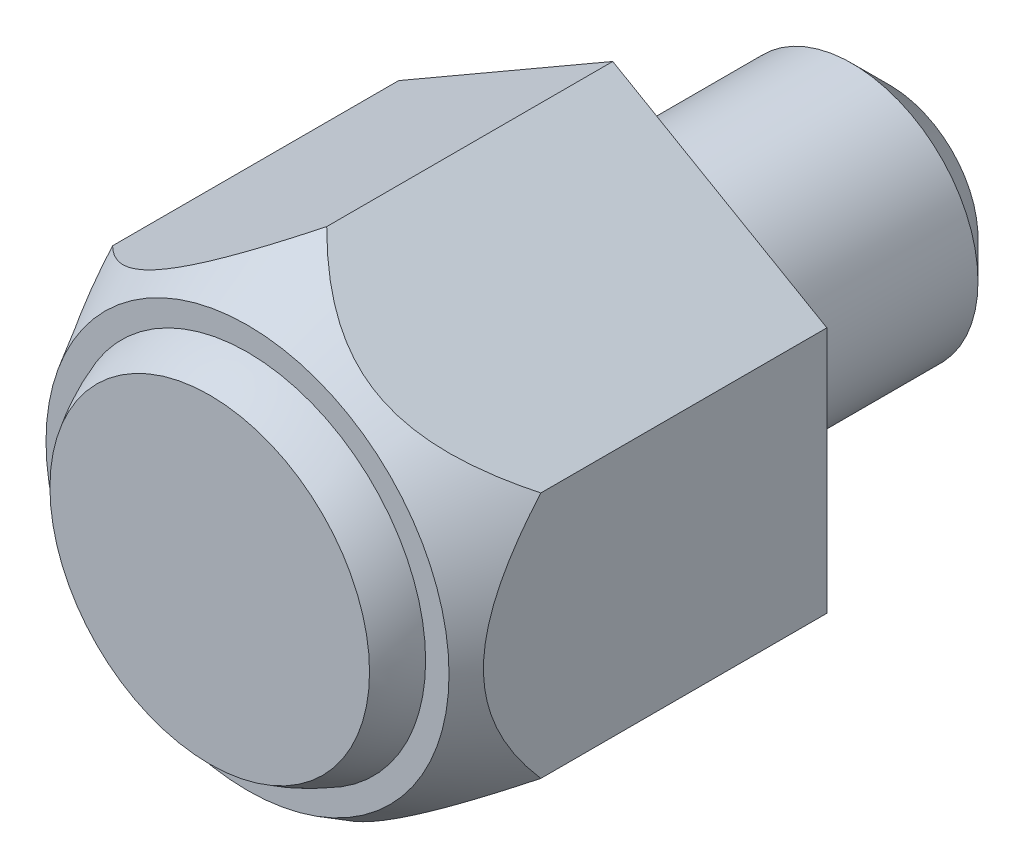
ISO-10303-21;
HEADER;
FILE_DESCRIPTION(('STEP AP214'),'2;1');
FILE_NAME('part.step','',(''),(''),'','','');
FILE_SCHEMA(('AUTOMOTIVE_DESIGN { 1 0 10303 214 1 1 1 1 }'));
ENDSEC;
DATA;
#1=APPLICATION_CONTEXT('core data for automotive mechanical design processes');
#2=APPLICATION_PROTOCOL_DEFINITION('international standard','automotive_design',2000,#1);
#3=PRODUCT_CONTEXT('',#1,'mechanical');
#4=PRODUCT('Part','Part','',(#3));
#5=PRODUCT_RELATED_PRODUCT_CATEGORY('part','',(#4));
#6=PRODUCT_DEFINITION_FORMATION('','',#4);
#7=PRODUCT_DEFINITION_CONTEXT('part definition',#1,'design');
#8=PRODUCT_DEFINITION('design','',#6,#7);
#9=PRODUCT_DEFINITION_SHAPE('','',#8);
#10=(LENGTH_UNIT() NAMED_UNIT(*) SI_UNIT(.MILLI.,.METRE.));
#11=(NAMED_UNIT(*) PLANE_ANGLE_UNIT() SI_UNIT($,.RADIAN.));
#12=(NAMED_UNIT(*) SI_UNIT($,.STERADIAN.) SOLID_ANGLE_UNIT());
#13=UNCERTAINTY_MEASURE_WITH_UNIT(LENGTH_MEASURE(1.E-05),#10,'distance_accuracy_value','');
#14=(GEOMETRIC_REPRESENTATION_CONTEXT(3) GLOBAL_UNCERTAINTY_ASSIGNED_CONTEXT((#13)) GLOBAL_UNIT_ASSIGNED_CONTEXT((#10,
#11,#12)) REPRESENTATION_CONTEXT('',''));
#15=CARTESIAN_POINT('',(0.,0.,0.));
#16=DIRECTION('',(0.,0.,1.));
#17=DIRECTION('',(1.,0.,0.));
#18=AXIS2_PLACEMENT_3D('',#15,#16,#17);
#19=CARTESIAN_POINT('',(0.,0.,16.));
#20=DIRECTION('',(0.,0.,1.));
#21=DIRECTION('',(1.,0.,0.));
#22=AXIS2_PLACEMENT_3D('',#19,#20,#21);
#23=PLANE('',#22);
#24=CARTESIAN_POINT('',(0.,0.,16.));
#25=DIRECTION('',(0.,0.,1.));
#26=DIRECTION('',(1.,0.,0.));
#27=AXIS2_PLACEMENT_3D('',#24,#25,#26);
#28=CIRCLE('',#27,6.34428877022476);
#29=CARTESIAN_POINT('',(6.34428877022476,0.,16.));
#30=VERTEX_POINT('',#29);
#31=EDGE_CURVE('E112',#30,#30,#28,.T.);
#32=ORIENTED_EDGE('',*,*,#31,.T.);
#33=EDGE_LOOP('',(#32));
#34=FACE_BOUND('',#33,.T.);
#35=ADVANCED_FACE('F14',(#34),#23,.T.);
#36=CARTESIAN_POINT('',(0.,0.,12.));
#37=DIRECTION('',(0.,0.,1.));
#38=DIRECTION('',(1.,0.,0.));
#39=AXIS2_PLACEMENT_3D('',#36,#37,#38);
#40=SPHERICAL_SURFACE('',#39,7.5);
#41=CARTESIAN_POINT('',(0.,0.,14.5));
#42=DIRECTION('',(0.,0.,1.));
#43=DIRECTION('',(1.,0.,0.));
#44=AXIS2_PLACEMENT_3D('',#41,#42,#43);
#45=CIRCLE('',#44,7.07106781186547);
#46=CARTESIAN_POINT('',(7.07106781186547,0.,14.5));
#47=VERTEX_POINT('',#46);
#48=EDGE_CURVE('E109',#47,#47,#45,.T.);
#49=CARTESIAN_POINT('',(7.07106781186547,0.,14.5));
#50=CARTESIAN_POINT('',(7.06526835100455,0.,14.5164033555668));
#51=CARTESIAN_POINT('',(7.05941180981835,0.,14.5327865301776));
#52=CARTESIAN_POINT('',(7.04758485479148,0.,14.5655117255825));
#53=CARTESIAN_POINT('',(7.04161444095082,0.,14.5818537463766));
#54=CARTESIAN_POINT('',(7.02956002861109,0.,14.6144958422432));
#55=CARTESIAN_POINT('',(7.02347603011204,0.,14.6307959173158));
#56=CARTESIAN_POINT('',(7.01119474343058,0.,14.6633533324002));
#57=CARTESIAN_POINT('',(7.00499745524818,0.,14.6796106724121));
#58=CARTESIAN_POINT('',(6.99248988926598,0.,14.7120818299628));
#59=CARTESIAN_POINT('',(6.98617961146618,0.,14.7282956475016));
#60=CARTESIAN_POINT('',(6.97344637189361,0.,14.7606789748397));
#61=CARTESIAN_POINT('',(6.96702341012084,0.,14.776848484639));
#62=CARTESIAN_POINT('',(6.95406511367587,0.,14.8091424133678));
#63=CARTESIAN_POINT('',(6.94752977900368,0.,14.8252668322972));
#64=CARTESIAN_POINT('',(6.93434705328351,0.,14.857469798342));
#65=CARTESIAN_POINT('',(6.92769966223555,0.,14.8735483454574));
#66=CARTESIAN_POINT('',(6.91429314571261,0.,14.9056587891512));
#67=CARTESIAN_POINT('',(6.90753402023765,0.,14.9216906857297));
#68=CARTESIAN_POINT('',(6.89390436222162,0.,14.9537070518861));
#69=CARTESIAN_POINT('',(6.88703382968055,0.,14.969691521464));
#70=CARTESIAN_POINT('',(6.87318169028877,0.,15.0016122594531));
#71=CARTESIAN_POINT('',(6.86620008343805,0.,15.0175485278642));
#72=CARTESIAN_POINT('',(6.85212613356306,0.,15.0493720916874));
#73=CARTESIAN_POINT('',(6.84503379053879,0.,15.0652593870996));
#74=CARTESIAN_POINT('',(6.830738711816,0.,15.0969842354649));
#75=CARTESIAN_POINT('',(6.82353597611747,0.,15.1128217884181));
#76=CARTESIAN_POINT('',(6.80902046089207,0.,15.1444463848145));
#77=CARTESIAN_POINT('',(6.80170768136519,0.,15.1602334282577));
#78=CARTESIAN_POINT('',(6.78697243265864,0.,15.1917562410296));
#79=CARTESIAN_POINT('',(6.77954996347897,0.,15.2074920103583));
#80=CARTESIAN_POINT('',(6.76459569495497,0.,15.2389115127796));
#81=CARTESIAN_POINT('',(6.75706389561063,0.,15.2545952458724));
#82=CARTESIAN_POINT('',(6.74189133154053,0.,15.2859099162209));
#83=CARTESIAN_POINT('',(6.73425056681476,0.,15.3015408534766));
#84=CARTESIAN_POINT('',(6.71886044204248,0.,15.332749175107));
#85=CARTESIAN_POINT('',(6.71111108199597,0.,15.3483265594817));
#86=CARTESIAN_POINT('',(6.69550414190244,0.,15.3794270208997));
#87=CARTESIAN_POINT('',(6.68764656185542,0.,15.394950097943));
#88=CARTESIAN_POINT('',(6.67182356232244,0.,15.4259411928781));
#89=CARTESIAN_POINT('',(6.66385814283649,0.,15.4414092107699));
#90=CARTESIAN_POINT('',(6.64781985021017,0.,15.4722894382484));
#91=CARTESIAN_POINT('',(6.6397469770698,0.,15.4877016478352));
#92=CARTESIAN_POINT('',(6.62349416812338,0.,15.5184695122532));
#93=CARTESIAN_POINT('',(6.61531423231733,0.,15.5338251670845));
#94=CARTESIAN_POINT('',(6.59884769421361,0.,15.56447917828));
#95=CARTESIAN_POINT('',(6.59056109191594,0.,15.5797775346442));
#96=CARTESIAN_POINT('',(6.57388162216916,0.,15.6103162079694));
#97=CARTESIAN_POINT('',(6.56548875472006,0.,15.6255565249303));
#98=CARTESIAN_POINT('',(6.54859716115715,0.,15.6559783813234));
#99=CARTESIAN_POINT('',(6.54009843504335,0.,15.6711599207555));
#100=CARTESIAN_POINT('',(6.52299553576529,0.,15.7014634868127));
#101=CARTESIAN_POINT('',(6.51439136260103,0.,15.7165855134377));
#102=CARTESIAN_POINT('',(6.49707798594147,0.,15.7467693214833));
#103=CARTESIAN_POINT('',(6.48836878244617,0.,15.761831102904));
#104=CARTESIAN_POINT('',(6.47084576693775,0.,15.7918936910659));
#105=CARTESIAN_POINT('',(6.46203195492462,0.,15.8068944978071));
#106=CARTESIAN_POINT('',(6.44430014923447,0.,15.8368344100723));
#107=CARTESIAN_POINT('',(6.43538215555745,0.,15.8517735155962));
#108=CARTESIAN_POINT('',(6.41744241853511,0.,15.8815893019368));
#109=CARTESIAN_POINT('',(6.40842067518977,0.,15.8964659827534));
#110=CARTESIAN_POINT('',(6.3902738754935,0.,15.9261561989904));
#111=CARTESIAN_POINT('',(6.38114881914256,0.,15.9409697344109));
#112=CARTESIAN_POINT('',(6.36279583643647,0.,15.9705329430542));
#113=CARTESIAN_POINT('',(6.35356791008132,0.,15.985282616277));
#114=CARTESIAN_POINT('',(6.34428877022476,0.,16.));
#115=B_SPLINE_CURVE_WITH_KNOTS('',3,(#49,#50,#51,#52,#53,#54,#55,#56,#57,#58,#59,#60,#61,#62,
#63,#64,#65,#66,#67,#68,#69,#70,#71,#72,#73,#74,#75,#76,#77,#78,#79,#80,#81,#82,#83,#84,#85,#86,
#87,#88,#89,#90,#91,#92,#93,#94,#95,#96,#97,#98,#99,#100,#101,#102,#103,#104,#105,#106,#107,
#108,#109,#110,#111,#112,#113,#114),.UNSPECIFIED.,.F.,.F.,(4,2,2,2,2,2,2,2,2,2,2,2,2,2,2,2,2,2,
2,2,2,2,2,2,2,2,2,2,2,2,2,2,4),(0.,0.0521950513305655,0.104390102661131,0.156585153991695,
0.20878020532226,0.260975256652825,0.313170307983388,0.365365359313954,0.417560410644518,
0.469755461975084,0.521950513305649,0.574145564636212,0.626340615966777,0.678535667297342,
0.730730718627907,0.782925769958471,0.835120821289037,0.887315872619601,0.939510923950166,
0.991705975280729,1.04390102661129,1.09609607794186,1.14829112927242,1.20048618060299,
1.25268123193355,1.30487628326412,1.35707133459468,1.40926638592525,1.46146143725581,
1.51365648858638,1.56585153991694,1.61804659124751,1.67024164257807),.UNSPECIFIED.);
#116=EDGE_CURVE('BSEAM183',#47,#30,#115,.T.);
#117=ORIENTED_EDGE('',*,*,#48,.T.);
#118=ORIENTED_EDGE('',*,*,#31,.F.);
#119=ORIENTED_EDGE('',*,*,#116,.T.);
#120=ORIENTED_EDGE('',*,*,#116,.F.);
#121=EDGE_LOOP('',(#117,#119,#118,#120));
#122=FACE_BOUND('',#121,.T.);
#123=ADVANCED_FACE('F183',(#122),#40,.T.);
#124=CARTESIAN_POINT('',(7.07106781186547,0.,14.5));
#125=DIRECTION('',(0.,0.,1.));
#126=DIRECTION('',(1.,0.,0.));
#127=AXIS2_PLACEMENT_3D('',#124,#125,#126);
#128=PLANE('',#127);
#129=CARTESIAN_POINT('',(0.,0.,14.5));
#130=DIRECTION('',(0.,0.,1.));
#131=DIRECTION('',(1.,0.,0.));
#132=AXIS2_PLACEMENT_3D('',#129,#130,#131);
#133=CIRCLE('',#132,8.);
#134=CARTESIAN_POINT('',(8.,0.,14.5));
#135=VERTEX_POINT('',#134);
#136=EDGE_CURVE('E79',#135,#135,#133,.T.);
#137=ORIENTED_EDGE('',*,*,#136,.T.);
#138=EDGE_LOOP('',(#137));
#139=FACE_BOUND('',#138,.T.);
#140=ORIENTED_EDGE('',*,*,#48,.F.);
#141=EDGE_LOOP('',(#140));
#142=FACE_BOUND('',#141,.T.);
#143=ADVANCED_FACE('F142',(#139,#142),#128,.T.);
#144=CARTESIAN_POINT('',(0.,0.,14.5));
#145=DIRECTION('',(0.,0.,-1.));
#146=DIRECTION('',(-1.,0.,0.));
#147=AXIS2_PLACEMENT_3D('',#144,#145,#146);
#148=CONICAL_SURFACE('',#147,8.,0.523598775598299);
#149=CARTESIAN_POINT('',(0.000200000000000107,-9.8150700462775,11.3562064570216));
#150=CARTESIAN_POINT('',(-0.0887034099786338,-9.76374163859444,11.4451038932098));
#151=CARTESIAN_POINT('',(-0.178493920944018,-9.71190106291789,11.5328156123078));
#152=CARTESIAN_POINT('',(-0.36004440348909,-9.60708284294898,11.7055370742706));
#153=CARTESIAN_POINT('',(-0.451804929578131,-9.55410487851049,11.7905460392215));
#154=CARTESIAN_POINT('',(-0.731203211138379,-9.39279420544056,12.0417976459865));
#155=CARTESIAN_POINT('',(-0.922055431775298,-9.2826056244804,12.2033518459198));
#156=CARTESIAN_POINT('',(-1.31861706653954,-9.05365065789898,12.5138890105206));
#157=CARTESIAN_POINT('',(-1.52458293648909,-8.93473620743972,12.6624393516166));
#158=CARTESIAN_POINT('',(-1.94767225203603,-8.69046547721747,12.9358613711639));
#159=CARTESIAN_POINT('',(-2.16476963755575,-8.56512424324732,13.0607854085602));
#160=CARTESIAN_POINT('',(-2.50885382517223,-8.36646714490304,13.2295721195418));
#161=CARTESIAN_POINT('',(-2.63181283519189,-8.29547672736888,13.2844299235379));
#162=CARTESIAN_POINT('',(-2.88095112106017,-8.15163667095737,13.3835112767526));
#163=CARTESIAN_POINT('',(-3.00713063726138,-8.07878689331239,13.4277340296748));
#164=CARTESIAN_POINT('',(-3.26120461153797,-7.93209721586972,13.5038548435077));
#165=CARTESIAN_POINT('',(-3.38907759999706,-7.85826971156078,13.5358476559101));
#166=CARTESIAN_POINT('',(-3.6467467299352,-7.70950437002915,13.5868445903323));
#167=CARTESIAN_POINT('',(-3.77654249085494,-7.63456675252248,13.6058512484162));
#168=CARTESIAN_POINT('',(-4.03830748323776,-7.48343666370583,13.6302298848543));
#169=CARTESIAN_POINT('',(-4.17028572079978,-7.40723899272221,13.6354745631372));
#170=CARTESIAN_POINT('',(-4.43408785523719,-7.25493275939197,13.631734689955));
#171=CARTESIAN_POINT('',(-4.56591175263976,-7.17882419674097,13.6227501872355));
#172=CARTESIAN_POINT('',(-4.82860472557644,-7.02715833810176,13.5908993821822));
#173=CARTESIAN_POINT('',(-4.95947073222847,-6.95160281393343,13.5679996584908));
#174=CARTESIAN_POINT('',(-5.21898420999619,-6.80177263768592,13.5092123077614));
#175=CARTESIAN_POINT('',(-5.34763137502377,-6.72749816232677,13.4733229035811));
#176=CARTESIAN_POINT('',(-5.63877743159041,-6.55940490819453,13.3777473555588));
#177=CARTESIAN_POINT('',(-5.80032071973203,-6.46613784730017,13.3141819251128));
#178=CARTESIAN_POINT('',(-6.11783783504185,-6.28281925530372,13.1705772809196));
#179=CARTESIAN_POINT('',(-6.27380816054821,-6.19276974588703,13.0905279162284));
#180=CARTESIAN_POINT('',(-6.58055906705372,-6.01566702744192,12.916551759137));
#181=CARTESIAN_POINT('',(-6.73131616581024,-5.92862737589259,12.8225702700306));
#182=CARTESIAN_POINT('',(-7.02715920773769,-5.7578223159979,12.6235470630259));
#183=CARTESIAN_POINT('',(-7.17224607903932,-5.67405637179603,12.5185071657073));
#184=CARTESIAN_POINT('',(-7.5235452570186,-5.4712336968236,12.2484741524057));
#185=CARTESIAN_POINT('',(-7.72678516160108,-5.35389308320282,12.0783274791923));
#186=CARTESIAN_POINT('',(-8.02325352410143,-5.18272699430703,11.8134593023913));
#187=CARTESIAN_POINT('',(-8.12015317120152,-5.12678195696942,11.7240937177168));
#188=CARTESIAN_POINT('',(-8.31176228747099,-5.01615638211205,11.5423273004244));
#189=CARTESIAN_POINT('',(-8.40647220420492,-4.96147558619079,11.4499270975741));
#190=CARTESIAN_POINT('',(-8.5002,-4.90736181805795,11.3562064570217));
#191=B_SPLINE_CURVE_WITH_KNOTS('',3,(#149,#150,#151,#152,#153,#154,#155,#156,#157,#158,#159,
#160,#161,#162,#163,#164,#165,#166,#167,#168,#169,#170,#171,#172,#173,#174,#175,#176,#177,#178,
#179,#180,#181,#182,#183,#184,#185,#186,#187,#188,#189,#190),.UNSPECIFIED.,.F.,.F.,(4,2,2,2,2,2,
2,2,2,2,2,2,2,2,2,2,2,2,2,2,4),(0.,0.407376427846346,0.814869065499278,1.63400495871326,
2.47430388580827,3.31271820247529,3.7690033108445,4.22532257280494,4.67803116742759,
5.13065132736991,5.58744375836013,6.04423462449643,6.50212696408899,6.96008197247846,
7.55031825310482,8.14091909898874,8.73390322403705,9.32678987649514,10.1955640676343,
10.6251214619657,11.0545902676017),.UNSPECIFIED.);
#192=CARTESIAN_POINT('',(0.,-9.81495457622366,11.356406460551));
#193=VERTEX_POINT('',#192);
#194=CARTESIAN_POINT('',(-8.5,-4.90747728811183,11.3564064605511));
#195=VERTEX_POINT('',#194);
#196=EDGE_CURVE('E170',#193,#195,#191,.T.);
#197=ORIENTED_EDGE('',*,*,#196,.F.);
#198=CARTESIAN_POINT('',(-0.000199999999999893,-9.8150700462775,11.3562064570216));
#199=CARTESIAN_POINT('',(0.0887034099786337,-9.76374163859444,11.4451038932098));
#200=CARTESIAN_POINT('',(0.178493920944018,-9.71190106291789,11.5328156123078));
#201=CARTESIAN_POINT('',(0.360044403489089,-9.60708284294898,11.7055370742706));
#202=CARTESIAN_POINT('',(0.45180492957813,-9.55410487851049,11.7905460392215));
#203=CARTESIAN_POINT('',(0.731203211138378,-9.39279420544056,12.0417976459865));
#204=CARTESIAN_POINT('',(0.922055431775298,-9.2826056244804,12.2033518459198));
#205=CARTESIAN_POINT('',(1.31861706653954,-9.05365065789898,12.5138890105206));
#206=CARTESIAN_POINT('',(1.52458293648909,-8.93473620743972,12.6624393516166));
#207=CARTESIAN_POINT('',(1.94767225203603,-8.69046547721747,12.9358613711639));
#208=CARTESIAN_POINT('',(2.16476963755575,-8.56512424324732,13.0607854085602));
#209=CARTESIAN_POINT('',(2.50885382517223,-8.36646714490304,13.2295721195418));
#210=CARTESIAN_POINT('',(2.63181283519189,-8.29547672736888,13.2844299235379));
#211=CARTESIAN_POINT('',(2.88095112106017,-8.15163667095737,13.3835112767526));
#212=CARTESIAN_POINT('',(3.00713063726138,-8.07878689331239,13.4277340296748));
#213=CARTESIAN_POINT('',(3.26120461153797,-7.93209721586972,13.5038548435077));
#214=CARTESIAN_POINT('',(3.38907759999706,-7.85826971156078,13.5358476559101));
#215=CARTESIAN_POINT('',(3.6467467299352,-7.70950437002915,13.5868445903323));
#216=CARTESIAN_POINT('',(3.77654249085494,-7.63456675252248,13.6058512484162));
#217=CARTESIAN_POINT('',(4.03830748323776,-7.48343666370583,13.6302298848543));
#218=CARTESIAN_POINT('',(4.17028572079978,-7.40723899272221,13.6354745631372));
#219=CARTESIAN_POINT('',(4.43408785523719,-7.25493275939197,13.631734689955));
#220=CARTESIAN_POINT('',(4.56591175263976,-7.17882419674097,13.6227501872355));
#221=CARTESIAN_POINT('',(4.82860472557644,-7.02715833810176,13.5908993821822));
#222=CARTESIAN_POINT('',(4.95947073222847,-6.95160281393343,13.5679996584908));
#223=CARTESIAN_POINT('',(5.21898420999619,-6.80177263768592,13.5092123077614));
#224=CARTESIAN_POINT('',(5.34763137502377,-6.72749816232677,13.4733229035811));
#225=CARTESIAN_POINT('',(5.63877743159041,-6.55940490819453,13.3777473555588));
#226=CARTESIAN_POINT('',(5.80032071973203,-6.46613784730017,13.3141819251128));
#227=CARTESIAN_POINT('',(6.11783783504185,-6.28281925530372,13.1705772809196));
#228=CARTESIAN_POINT('',(6.27380816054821,-6.19276974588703,13.0905279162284));
#229=CARTESIAN_POINT('',(6.58055906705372,-6.01566702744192,12.916551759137));
#230=CARTESIAN_POINT('',(6.73131616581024,-5.92862737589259,12.8225702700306));
#231=CARTESIAN_POINT('',(7.02715920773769,-5.7578223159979,12.6235470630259));
#232=CARTESIAN_POINT('',(7.17224607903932,-5.67405637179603,12.5185071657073));
#233=CARTESIAN_POINT('',(7.5235452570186,-5.4712336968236,12.2484741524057));
#234=CARTESIAN_POINT('',(7.72678516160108,-5.35389308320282,12.0783274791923));
#235=CARTESIAN_POINT('',(8.02325352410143,-5.18272699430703,11.8134593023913));
#236=CARTESIAN_POINT('',(8.12015317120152,-5.12678195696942,11.7240937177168));
#237=CARTESIAN_POINT('',(8.31176228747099,-5.01615638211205,11.5423273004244));
#238=CARTESIAN_POINT('',(8.40647220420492,-4.96147558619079,11.4499270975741));
#239=CARTESIAN_POINT('',(8.5002,-4.90736181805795,11.3562064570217));
#240=B_SPLINE_CURVE_WITH_KNOTS('',3,(#198,#199,#200,#201,#202,#203,#204,#205,#206,#207,#208,
#209,#210,#211,#212,#213,#214,#215,#216,#217,#218,#219,#220,#221,#222,#223,#224,#225,#226,#227,
#228,#229,#230,#231,#232,#233,#234,#235,#236,#237,#238,#239),.UNSPECIFIED.,.F.,.F.,(4,2,2,2,2,2,
2,2,2,2,2,2,2,2,2,2,2,2,2,2,4),(0.,0.407376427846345,0.814869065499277,1.63400495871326,
2.47430388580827,3.31271820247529,3.7690033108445,4.22532257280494,4.67803116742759,
5.13065132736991,5.58744375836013,6.04423462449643,6.50212696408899,6.96008197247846,
7.55031825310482,8.14091909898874,8.73390322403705,9.32678987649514,10.1955640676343,
10.6251214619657,11.0545902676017),.UNSPECIFIED.);
#241=CARTESIAN_POINT('',(8.5,-4.90747728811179,11.356406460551));
#242=VERTEX_POINT('',#241);
#243=EDGE_CURVE('E76',#193,#242,#240,.T.);
#244=ORIENTED_EDGE('',*,*,#243,.T.);
#245=CARTESIAN_POINT('',(8.5,-10.9744945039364,4.31334948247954));
#246=CARTESIAN_POINT('',(8.5,-10.7453930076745,4.62700647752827));
#247=CARTESIAN_POINT('',(8.5,-10.5145886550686,4.93943604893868));
#248=CARTESIAN_POINT('',(8.5,-10.048802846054,5.5612658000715));
#249=CARTESIAN_POINT('',(8.5,-9.81382052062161,5.87066532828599));
#250=CARTESIAN_POINT('',(8.5,-9.33687136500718,6.48848939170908));
#251=CARTESIAN_POINT('',(8.5,-9.0948607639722,6.79688022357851));
#252=CARTESIAN_POINT('',(8.5,-8.60493288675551,7.40889697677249));
#253=CARTESIAN_POINT('',(8.5,-8.35701618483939,7.71252335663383));
#254=CARTESIAN_POINT('',(8.5,-7.82605602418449,8.34719348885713));
#255=CARTESIAN_POINT('',(8.5,-7.54217031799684,8.67753509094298));
#256=CARTESIAN_POINT('',(8.5,-6.96316294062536,9.32850738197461));
#257=CARTESIAN_POINT('',(8.5,-6.66803763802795,9.64913487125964));
#258=CARTESIAN_POINT('',(8.5,-6.21527282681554,10.1192030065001));
#259=CARTESIAN_POINT('',(8.5,-6.0629752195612,10.2737923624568));
#260=CARTESIAN_POINT('',(8.5,-5.75436163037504,10.5788985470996));
#261=CARTESIAN_POINT('',(8.5,-5.5980459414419,10.7294156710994));
#262=CARTESIAN_POINT('',(8.5,-5.28093422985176,11.0254707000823));
#263=CARTESIAN_POINT('',(8.5,-5.12014098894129,11.1710115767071));
#264=CARTESIAN_POINT('',(8.5,-4.79336964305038,11.4561287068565));
#265=CARTESIAN_POINT('',(8.5,-4.62739243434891,11.5957059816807));
#266=CARTESIAN_POINT('',(8.5,-4.35199921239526,11.817269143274));
#267=CARTESIAN_POINT('',(8.5,-4.24436271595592,11.901466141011));
#268=CARTESIAN_POINT('',(8.5,-4.02655575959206,12.0665108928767));
#269=CARTESIAN_POINT('',(8.5,-3.91638527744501,12.1473586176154));
#270=CARTESIAN_POINT('',(8.5,-3.58163319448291,12.3842568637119));
#271=CARTESIAN_POINT('',(8.5,-3.35291246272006,12.5345795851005));
#272=CARTESIAN_POINT('',(8.5,-2.88697929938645,12.8125082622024));
#273=CARTESIAN_POINT('',(8.5,-2.6499658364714,12.9404443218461));
#274=CARTESIAN_POINT('',(8.5,-2.16351444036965,13.1699377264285));
#275=CARTESIAN_POINT('',(8.5,-1.91409359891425,13.2715302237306));
#276=CARTESIAN_POINT('',(8.5,-1.51925696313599,13.4025495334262));
#277=CARTESIAN_POINT('',(8.5,-1.37774635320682,13.4438463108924));
#278=CARTESIAN_POINT('',(8.5,-1.09186678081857,13.5150262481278));
#279=CARTESIAN_POINT('',(8.5,-0.94749828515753,13.5449112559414));
#280=CARTESIAN_POINT('',(8.5,-0.656800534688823,13.5922136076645));
#281=CARTESIAN_POINT('',(8.5,-0.510472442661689,13.6096380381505));
#282=CARTESIAN_POINT('',(8.5,-0.216832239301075,13.6313762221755));
#283=CARTESIAN_POINT('',(8.5,-0.0695201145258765,13.635689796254));
#284=CARTESIAN_POINT('',(8.5,0.225080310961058,13.6310266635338));
#285=CARTESIAN_POINT('',(8.5,0.372368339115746,13.6220329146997));
#286=CARTESIAN_POINT('',(8.5,0.665560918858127,13.5910869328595));
#287=CARTESIAN_POINT('',(8.5,0.811465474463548,13.5691347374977));
#288=CARTESIAN_POINT('',(8.5,1.10104674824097,13.5130671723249));
#289=CARTESIAN_POINT('',(8.5,1.24472112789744,13.4789398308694));
#290=CARTESIAN_POINT('',(8.5,1.52898207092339,13.399659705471));
#291=CARTESIAN_POINT('',(8.5,1.66956814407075,13.3545051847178));
#292=CARTESIAN_POINT('',(8.5,2.01628642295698,13.2295358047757));
#293=CARTESIAN_POINT('',(8.5,2.2202367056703,13.1436527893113));
#294=CARTESIAN_POINT('',(8.5,2.61973344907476,12.9541975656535));
#295=CARTESIAN_POINT('',(8.5,2.81527467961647,12.8506145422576));
#296=CARTESIAN_POINT('',(8.5,3.20029423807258,12.6282233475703));
#297=CARTESIAN_POINT('',(8.5,3.38968293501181,12.5092611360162));
#298=CARTESIAN_POINT('',(8.5,3.66795718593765,12.3223847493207));
#299=CARTESIAN_POINT('',(8.5,3.75973075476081,12.2586996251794));
#300=CARTESIAN_POINT('',(8.5,3.94147130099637,12.1288052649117));
#301=CARTESIAN_POINT('',(8.5,4.03143833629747,12.0625961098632));
#302=CARTESIAN_POINT('',(8.5,4.31951937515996,11.8449425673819));
#303=CARTESIAN_POINT('',(8.5,4.51426019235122,11.6890207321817));
#304=CARTESIAN_POINT('',(8.5,4.89643592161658,11.3684270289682));
#305=CARTESIAN_POINT('',(8.5,5.08386843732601,11.2037523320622));
#306=CARTESIAN_POINT('',(8.5,5.45261912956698,10.8672836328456));
#307=CARTESIAN_POINT('',(8.5,5.6339297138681,10.6954813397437));
#308=CARTESIAN_POINT('',(8.5,5.99105849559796,10.3463202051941));
#309=CARTESIAN_POINT('',(8.5,6.16687727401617,10.1689619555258));
#310=CARTESIAN_POINT('',(8.5,6.51487640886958,9.80857327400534));
#311=CARTESIAN_POINT('',(8.5,6.68702713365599,9.6255143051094));
#312=CARTESIAN_POINT('',(8.5,7.02718567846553,9.2555804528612));
#313=CARTESIAN_POINT('',(8.5,7.19519327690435,9.06870536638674));
#314=CARTESIAN_POINT('',(8.5,7.69360178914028,8.50358238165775));
#315=CARTESIAN_POINT('',(8.5,8.01862476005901,8.12058851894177));
#316=CARTESIAN_POINT('',(8.5,8.62476058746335,7.3853676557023));
#317=CARTESIAN_POINT('',(8.5,8.90695357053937,7.03402323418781));
#318=CARTESIAN_POINT('',(8.5,9.46419306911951,6.32562271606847));
#319=CARTESIAN_POINT('',(8.5,9.73923835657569,5.96856565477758));
#320=CARTESIAN_POINT('',(8.5,10.2797738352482,5.25487999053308));
#321=CARTESIAN_POINT('',(8.5,10.5453429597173,4.89831096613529));
#322=CARTESIAN_POINT('',(8.5,11.0716108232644,4.1817603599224));
#323=CARTESIAN_POINT('',(8.5,11.332311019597,3.82177984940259));
#324=CARTESIAN_POINT('',(8.5,11.5910795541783,3.46043538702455));
#325=B_SPLINE_CURVE_WITH_KNOTS('',3,(#245,#246,#247,#248,#249,#250,#251,#252,#253,#254,#255,
#256,#257,#258,#259,#260,#261,#262,#263,#264,#265,#266,#267,#268,#269,#270,#271,#272,#273,#274,
#275,#276,#277,#278,#279,#280,#281,#282,#283,#284,#285,#286,#287,#288,#289,#290,#291,#292,#293,
#294,#295,#296,#297,#298,#299,#300,#301,#302,#303,#304,#305,#306,#307,#308,#309,#310,#311,#312,
#313,#314,#315,#316,#317,#318,#319,#320,#321,#322,#323,#324),.UNSPECIFIED.,.F.,.F.,(4,2,2,2,2,2,
2,2,2,2,2,2,2,2,2,2,2,2,2,2,2,2,2,2,2,2,2,2,2,2,2,2,2,2,2,2,2,2,2,4),(0.,1.16526672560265,
2.33077873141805,3.50675664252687,4.68262067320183,5.98913776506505,7.29608062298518,
7.94704505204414,8.59796214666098,9.24848349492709,9.89889298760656,10.3087994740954,
10.7187095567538,11.5389221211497,12.3457762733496,13.1515481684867,13.59339136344,
14.0351629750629,14.4766831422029,14.918209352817,15.3603014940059,15.8023923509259,
16.2449191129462,16.6875156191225,17.3502752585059,18.0134413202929,18.6838559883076,
19.0189398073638,19.3540128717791,20.1020615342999,20.8503534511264,21.5995416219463,
22.3486502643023,23.1024438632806,23.8562776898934,25.362917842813,26.7147383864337,
28.0667896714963,29.4005458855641,30.7338962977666),.UNSPECIFIED.);
#326=CARTESIAN_POINT('',(8.5,4.90747728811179,11.356406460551));
#327=VERTEX_POINT('',#326);
#328=EDGE_CURVE('E160',#327,#242,#325,.F.);
#329=ORIENTED_EDGE('',*,*,#328,.F.);
#330=CARTESIAN_POINT('',(-0.000199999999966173,9.81507004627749,11.3562064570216));
#331=CARTESIAN_POINT('',(0.0887034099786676,9.76374163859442,11.4451038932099));
#332=CARTESIAN_POINT('',(0.178493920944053,9.71190106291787,11.5328156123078));
#333=CARTESIAN_POINT('',(0.360044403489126,9.60708284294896,11.7055370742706));
#334=CARTESIAN_POINT('',(0.451804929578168,9.55410487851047,11.7905460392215));
#335=CARTESIAN_POINT('',(0.731203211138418,9.39279420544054,12.0417976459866));
#336=CARTESIAN_POINT('',(0.922055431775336,9.28260562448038,12.2033518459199));
#337=CARTESIAN_POINT('',(1.31861706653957,9.05365065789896,12.5138890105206));
#338=CARTESIAN_POINT('',(1.52458293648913,8.9347362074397,12.6624393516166));
#339=CARTESIAN_POINT('',(1.94767225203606,8.69046547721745,12.9358613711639));
#340=CARTESIAN_POINT('',(2.16476963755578,8.5651242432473,13.0607854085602));
#341=CARTESIAN_POINT('',(2.50885382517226,8.36646714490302,13.2295721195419));
#342=CARTESIAN_POINT('',(2.63181283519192,8.29547672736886,13.2844299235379));
#343=CARTESIAN_POINT('',(2.88095112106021,8.15163667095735,13.3835112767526));
#344=CARTESIAN_POINT('',(3.00713063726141,8.07878689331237,13.4277340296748));
#345=CARTESIAN_POINT('',(3.261204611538,7.9320972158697,13.5038548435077));
#346=CARTESIAN_POINT('',(3.38907759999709,7.85826971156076,13.5358476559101));
#347=CARTESIAN_POINT('',(3.64674672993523,7.70950437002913,13.5868445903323));
#348=CARTESIAN_POINT('',(3.77654249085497,7.63456675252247,13.6058512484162));
#349=CARTESIAN_POINT('',(4.0383074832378,7.48343666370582,13.6302298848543));
#350=CARTESIAN_POINT('',(4.17028572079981,7.4072389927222,13.6354745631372));
#351=CARTESIAN_POINT('',(4.43408785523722,7.25493275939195,13.631734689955));
#352=CARTESIAN_POINT('',(4.56591175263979,7.17882419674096,13.6227501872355));
#353=CARTESIAN_POINT('',(4.82860472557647,7.02715833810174,13.5908993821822));
#354=CARTESIAN_POINT('',(4.9594707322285,6.95160281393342,13.5679996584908));
#355=CARTESIAN_POINT('',(5.21898420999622,6.8017726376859,13.5092123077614));
#356=CARTESIAN_POINT('',(5.3476313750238,6.72749816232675,13.4733229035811));
#357=CARTESIAN_POINT('',(5.63877743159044,6.55940490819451,13.3777473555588));
#358=CARTESIAN_POINT('',(5.80032071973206,6.46613784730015,13.3141819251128));
#359=CARTESIAN_POINT('',(6.11783783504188,6.2828192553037,13.1705772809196));
#360=CARTESIAN_POINT('',(6.27380816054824,6.19276974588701,13.0905279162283));
#361=CARTESIAN_POINT('',(6.58055906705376,6.01566702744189,12.9165517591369));
#362=CARTESIAN_POINT('',(6.73131616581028,5.92862737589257,12.8225702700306));
#363=CARTESIAN_POINT('',(7.02715920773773,5.75782231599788,12.6235470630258));
#364=CARTESIAN_POINT('',(7.17224607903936,5.67405637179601,12.5185071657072));
#365=CARTESIAN_POINT('',(7.52354525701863,5.47123369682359,12.2484741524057));
#366=CARTESIAN_POINT('',(7.72678516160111,5.35389308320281,12.0783274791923));
#367=CARTESIAN_POINT('',(8.02325352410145,5.18272699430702,11.8134593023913));
#368=CARTESIAN_POINT('',(8.12015317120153,5.12678195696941,11.7240937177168));
#369=CARTESIAN_POINT('',(8.31176228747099,5.01615638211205,11.5423273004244));
#370=CARTESIAN_POINT('',(8.40647220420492,4.96147558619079,11.4499270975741));
#371=CARTESIAN_POINT('',(8.5002,4.90736181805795,11.3562064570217));
#372=B_SPLINE_CURVE_WITH_KNOTS('',3,(#330,#331,#332,#333,#334,#335,#336,#337,#338,#339,#340,
#341,#342,#343,#344,#345,#346,#347,#348,#349,#350,#351,#352,#353,#354,#355,#356,#357,#358,#359,
#360,#361,#362,#363,#364,#365,#366,#367,#368,#369,#370,#371),.UNSPECIFIED.,.F.,.F.,(4,2,2,2,2,2,
2,2,2,2,2,2,2,2,2,2,2,2,2,2,4),(0.,0.407376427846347,0.81486906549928,1.63400495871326,
2.47430388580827,3.31271820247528,3.76900331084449,4.22532257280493,4.67803116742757,
5.1306513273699,5.58744375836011,6.04423462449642,6.50212696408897,6.96008197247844,
7.55031825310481,8.14091909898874,8.73390322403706,9.32678987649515,10.1955640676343,
10.6251214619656,11.0545902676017),.UNSPECIFIED.);
#373=CARTESIAN_POINT('',(0.,9.81495457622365,11.356406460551));
#374=VERTEX_POINT('',#373);
#375=EDGE_CURVE('E153',#374,#327,#372,.T.);
#376=ORIENTED_EDGE('',*,*,#375,.F.);
#377=CARTESIAN_POINT('',(0.000200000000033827,9.81507004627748,11.3562064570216));
#378=CARTESIAN_POINT('',(-0.0887034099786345,9.76374163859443,11.4451038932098));
#379=CARTESIAN_POINT('',(-0.178493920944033,9.71190106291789,11.5328156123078));
#380=CARTESIAN_POINT('',(-0.360044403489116,9.60708284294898,11.7055370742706));
#381=CARTESIAN_POINT('',(-0.451804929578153,9.5541048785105,11.7905460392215));
#382=CARTESIAN_POINT('',(-0.731203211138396,9.39279420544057,12.0417976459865));
#383=CARTESIAN_POINT('',(-0.922055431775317,9.28260562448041,12.2033518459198));
#384=CARTESIAN_POINT('',(-1.31861706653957,9.05365065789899,12.5138890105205));
#385=CARTESIAN_POINT('',(-1.52458293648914,8.93473620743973,12.6624393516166));
#386=CARTESIAN_POINT('',(-1.94767225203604,8.69046547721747,12.9358613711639));
#387=CARTESIAN_POINT('',(-2.16476963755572,8.5651242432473,13.0607854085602));
#388=CARTESIAN_POINT('',(-2.50885382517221,8.36646714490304,13.2295721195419));
#389=CARTESIAN_POINT('',(-2.6318128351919,8.29547672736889,13.2844299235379));
#390=CARTESIAN_POINT('',(-2.88095112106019,8.15163667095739,13.3835112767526));
#391=CARTESIAN_POINT('',(-3.00713063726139,8.07878689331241,13.4277340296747));
#392=CARTESIAN_POINT('',(-3.26120461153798,7.93209721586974,13.5038548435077));
#393=CARTESIAN_POINT('',(-3.38907759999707,7.8582697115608,13.5358476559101));
#394=CARTESIAN_POINT('',(-3.64674672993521,7.70950437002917,13.5868445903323));
#395=CARTESIAN_POINT('',(-3.77654249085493,7.63456675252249,13.6058512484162));
#396=CARTESIAN_POINT('',(-4.03830748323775,7.48343666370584,13.6302298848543));
#397=CARTESIAN_POINT('',(-4.17028572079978,7.40723899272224,13.6354745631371));
#398=CARTESIAN_POINT('',(-4.43408785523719,7.25493275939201,13.6317346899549));
#399=CARTESIAN_POINT('',(-4.56591175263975,7.17882419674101,13.6227501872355));
#400=CARTESIAN_POINT('',(-4.82860472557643,7.0271583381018,13.5908993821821));
#401=CARTESIAN_POINT('',(-4.95947073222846,6.95160281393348,13.5679996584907));
#402=CARTESIAN_POINT('',(-5.21898420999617,6.80177263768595,13.5092123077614));
#403=CARTESIAN_POINT('',(-5.34763137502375,6.72749816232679,13.4733229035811));
#404=CARTESIAN_POINT('',(-5.63877743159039,6.55940490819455,13.3777473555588));
#405=CARTESIAN_POINT('',(-5.80032071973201,6.46613784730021,13.3141819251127));
#406=CARTESIAN_POINT('',(-6.11783783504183,6.28281925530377,13.1705772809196));
#407=CARTESIAN_POINT('',(-6.2738081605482,6.19276974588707,13.0905279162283));
#408=CARTESIAN_POINT('',(-6.58055906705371,6.01566702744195,12.9165517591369));
#409=CARTESIAN_POINT('',(-6.73131616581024,5.92862737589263,12.8225702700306));
#410=CARTESIAN_POINT('',(-7.0271592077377,5.75782231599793,12.6235470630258));
#411=CARTESIAN_POINT('',(-7.17224607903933,5.67405637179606,12.5185071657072));
#412=CARTESIAN_POINT('',(-7.52354525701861,5.47123369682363,12.2484741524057));
#413=CARTESIAN_POINT('',(-7.72678516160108,5.35389308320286,12.0783274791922));
#414=CARTESIAN_POINT('',(-8.02325352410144,5.18272699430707,11.8134593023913));
#415=CARTESIAN_POINT('',(-8.12015317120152,5.12678195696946,11.7240937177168));
#416=CARTESIAN_POINT('',(-8.31176228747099,5.01615638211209,11.5423273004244));
#417=CARTESIAN_POINT('',(-8.40647220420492,4.96147558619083,11.4499270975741));
#418=CARTESIAN_POINT('',(-8.5002,4.907361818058,11.3562064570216));
#419=B_SPLINE_CURVE_WITH_KNOTS('',3,(#377,#378,#379,#380,#381,#382,#383,#384,#385,#386,#387,
#388,#389,#390,#391,#392,#393,#394,#395,#396,#397,#398,#399,#400,#401,#402,#403,#404,#405,#406,
#407,#408,#409,#410,#411,#412,#413,#414,#415,#416,#417,#418),.UNSPECIFIED.,.F.,.F.,(4,2,2,2,2,2,
2,2,2,2,2,2,2,2,2,2,2,2,2,2,4),(0.,0.40737642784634,0.814869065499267,1.63400495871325,
2.47430388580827,3.31271820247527,3.76900331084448,4.22532257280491,4.67803116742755,
5.13065132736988,5.58744375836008,6.04423462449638,6.50212696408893,6.9600819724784,
7.55031825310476,8.14091909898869,8.73390322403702,9.32678987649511,10.1955640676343,
10.6251214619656,11.0545902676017),.UNSPECIFIED.);
#420=CARTESIAN_POINT('',(-8.5,4.90747728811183,11.356406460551));
#421=VERTEX_POINT('',#420);
#422=EDGE_CURVE('E127',#374,#421,#419,.T.);
#423=ORIENTED_EDGE('',*,*,#422,.T.);
#424=CARTESIAN_POINT('',(-8.5,-10.9744945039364,4.31334948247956));
#425=CARTESIAN_POINT('',(-8.5,-10.7453930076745,4.6270064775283));
#426=CARTESIAN_POINT('',(-8.5,-10.5145886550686,4.93943604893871));
#427=CARTESIAN_POINT('',(-8.5,-10.048802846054,5.56126580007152));
#428=CARTESIAN_POINT('',(-8.5,-9.8138205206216,5.87066532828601));
#429=CARTESIAN_POINT('',(-8.5,-9.33687136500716,6.4884893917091));
#430=CARTESIAN_POINT('',(-8.5,-9.09486076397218,6.79688022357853));
#431=CARTESIAN_POINT('',(-8.5,-8.60493288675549,7.40889697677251));
#432=CARTESIAN_POINT('',(-8.5,-8.35701618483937,7.71252335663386));
#433=CARTESIAN_POINT('',(-8.5,-7.82605602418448,8.34719348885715));
#434=CARTESIAN_POINT('',(-8.5,-7.54217031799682,8.677535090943));
#435=CARTESIAN_POINT('',(-8.5,-6.96316294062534,9.32850738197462));
#436=CARTESIAN_POINT('',(-8.5,-6.66803763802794,9.64913487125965));
#437=CARTESIAN_POINT('',(-8.5,-6.21527282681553,10.1192030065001));
#438=CARTESIAN_POINT('',(-8.5,-6.0629752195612,10.2737923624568));
#439=CARTESIAN_POINT('',(-8.5,-5.75436163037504,10.5788985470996));
#440=CARTESIAN_POINT('',(-8.5,-5.59804594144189,10.7294156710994));
#441=CARTESIAN_POINT('',(-8.5,-5.28093422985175,11.0254707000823));
#442=CARTESIAN_POINT('',(-8.5,-5.12014098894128,11.1710115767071));
#443=CARTESIAN_POINT('',(-8.5,-4.79336964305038,11.4561287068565));
#444=CARTESIAN_POINT('',(-8.5,-4.62739243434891,11.5957059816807));
#445=CARTESIAN_POINT('',(-8.5,-4.35199921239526,11.817269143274));
#446=CARTESIAN_POINT('',(-8.5,-4.24436271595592,11.901466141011));
#447=CARTESIAN_POINT('',(-8.5,-4.02655575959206,12.0665108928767));
#448=CARTESIAN_POINT('',(-8.5,-3.916385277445,12.1473586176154));
#449=CARTESIAN_POINT('',(-8.5,-3.5816331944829,12.3842568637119));
#450=CARTESIAN_POINT('',(-8.5,-3.35291246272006,12.5345795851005));
#451=CARTESIAN_POINT('',(-8.5,-2.88697929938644,12.8125082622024));
#452=CARTESIAN_POINT('',(-8.5,-2.6499658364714,12.9404443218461));
#453=CARTESIAN_POINT('',(-8.5,-2.16351444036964,13.1699377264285));
#454=CARTESIAN_POINT('',(-8.5,-1.91409359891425,13.2715302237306));
#455=CARTESIAN_POINT('',(-8.5,-1.51925696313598,13.4025495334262));
#456=CARTESIAN_POINT('',(-8.5,-1.37774635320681,13.4438463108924));
#457=CARTESIAN_POINT('',(-8.5,-1.09186678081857,13.5150262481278));
#458=CARTESIAN_POINT('',(-8.5,-0.947498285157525,13.5449112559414));
#459=CARTESIAN_POINT('',(-8.5,-0.656800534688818,13.5922136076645));
#460=CARTESIAN_POINT('',(-8.5,-0.510472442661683,13.6096380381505));
#461=CARTESIAN_POINT('',(-8.5,-0.21683223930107,13.6313762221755));
#462=CARTESIAN_POINT('',(-8.5,-0.069520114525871,13.635689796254));
#463=CARTESIAN_POINT('',(-8.5,0.225080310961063,13.6310266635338));
#464=CARTESIAN_POINT('',(-8.5,0.372368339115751,13.6220329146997));
#465=CARTESIAN_POINT('',(-8.5,0.665560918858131,13.5910869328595));
#466=CARTESIAN_POINT('',(-8.5,0.811465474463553,13.5691347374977));
#467=CARTESIAN_POINT('',(-8.5,1.10104674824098,13.5130671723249));
#468=CARTESIAN_POINT('',(-8.5,1.24472112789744,13.4789398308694));
#469=CARTESIAN_POINT('',(-8.5,1.52898207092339,13.399659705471));
#470=CARTESIAN_POINT('',(-8.5,1.66956814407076,13.3545051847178));
#471=CARTESIAN_POINT('',(-8.5,2.01628642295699,13.2295358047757));
#472=CARTESIAN_POINT('',(-8.5,2.22023670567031,13.1436527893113));
#473=CARTESIAN_POINT('',(-8.5,2.61973344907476,12.9541975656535));
#474=CARTESIAN_POINT('',(-8.5,2.81527467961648,12.8506145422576));
#475=CARTESIAN_POINT('',(-8.5,3.20029423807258,12.6282233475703));
#476=CARTESIAN_POINT('',(-8.5,3.38968293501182,12.5092611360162));
#477=CARTESIAN_POINT('',(-8.5,3.66795718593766,12.3223847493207));
#478=CARTESIAN_POINT('',(-8.5,3.75973075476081,12.2586996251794));
#479=CARTESIAN_POINT('',(-8.5,3.94147130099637,12.1288052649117));
#480=CARTESIAN_POINT('',(-8.5,4.03143833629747,12.0625961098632));
#481=CARTESIAN_POINT('',(-8.5,4.31951937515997,11.8449425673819));
#482=CARTESIAN_POINT('',(-8.5,4.51426019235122,11.6890207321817));
#483=CARTESIAN_POINT('',(-8.5,4.89643592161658,11.3684270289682));
#484=CARTESIAN_POINT('',(-8.5,5.08386843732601,11.2037523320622));
#485=CARTESIAN_POINT('',(-8.5,5.45261912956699,10.8672836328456));
#486=CARTESIAN_POINT('',(-8.5,5.63392971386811,10.6954813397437));
#487=CARTESIAN_POINT('',(-8.5,5.99105849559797,10.3463202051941));
#488=CARTESIAN_POINT('',(-8.5,6.16687727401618,10.1689619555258));
#489=CARTESIAN_POINT('',(-8.5,6.51487640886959,9.80857327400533));
#490=CARTESIAN_POINT('',(-8.5,6.687027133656,9.62551430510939));
#491=CARTESIAN_POINT('',(-8.5,7.02718567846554,9.25558045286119));
#492=CARTESIAN_POINT('',(-8.5,7.19519327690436,9.06870536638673));
#493=CARTESIAN_POINT('',(-8.5,7.6936017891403,8.50358238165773));
#494=CARTESIAN_POINT('',(-8.5,8.01862476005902,8.12058851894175));
#495=CARTESIAN_POINT('',(-8.5,8.62476058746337,7.38536765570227));
#496=CARTESIAN_POINT('',(-8.5,8.90695357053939,7.03402323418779));
#497=CARTESIAN_POINT('',(-8.5,9.46419306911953,6.32562271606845));
#498=CARTESIAN_POINT('',(-8.5,9.73923835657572,5.96856565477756));
#499=CARTESIAN_POINT('',(-8.5,10.2797738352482,5.25487999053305));
#500=CARTESIAN_POINT('',(-8.5,10.5453429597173,4.89831096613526));
#501=CARTESIAN_POINT('',(-8.5,11.0716108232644,4.18176035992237));
#502=CARTESIAN_POINT('',(-8.5,11.3323110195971,3.82177984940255));
#503=CARTESIAN_POINT('',(-8.5,11.5910795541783,3.46043538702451));
#504=B_SPLINE_CURVE_WITH_KNOTS('',3,(#424,#425,#426,#427,#428,#429,#430,#431,#432,#433,#434,
#435,#436,#437,#438,#439,#440,#441,#442,#443,#444,#445,#446,#447,#448,#449,#450,#451,#452,#453,
#454,#455,#456,#457,#458,#459,#460,#461,#462,#463,#464,#465,#466,#467,#468,#469,#470,#471,#472,
#473,#474,#475,#476,#477,#478,#479,#480,#481,#482,#483,#484,#485,#486,#487,#488,#489,#490,#491,
#492,#493,#494,#495,#496,#497,#498,#499,#500,#501,#502,#503),.UNSPECIFIED.,.F.,.F.,(4,2,2,2,2,2,
2,2,2,2,2,2,2,2,2,2,2,2,2,2,2,2,2,2,2,2,2,2,2,2,2,2,2,2,2,2,2,2,2,4),(0.,1.16526672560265,
2.33077873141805,3.50675664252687,4.68262067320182,5.98913776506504,7.29608062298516,
7.94704505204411,8.59796214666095,9.24848349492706,9.89889298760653,10.3087994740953,
10.7187095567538,11.5389221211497,12.3457762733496,13.1515481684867,13.59339136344,
14.0351629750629,14.4766831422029,14.918209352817,15.3603014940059,15.8023923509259,
16.2449191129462,16.6875156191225,17.3502752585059,18.0134413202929,18.6838559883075,
19.0189398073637,19.3540128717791,20.1020615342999,20.8503534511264,21.5995416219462,
22.3486502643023,23.1024438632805,23.8562776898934,25.362917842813,26.7147383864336,
28.0667896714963,29.4005458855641,30.7338962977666),.UNSPECIFIED.);
#505=EDGE_CURVE('E118',#421,#195,#504,.F.);
#506=ORIENTED_EDGE('',*,*,#505,.T.);
#507=EDGE_LOOP('',(#197,#244,#329,#376,#423,#506));
#508=FACE_BOUND('',#507,.T.);
#509=ORIENTED_EDGE('',*,*,#136,.F.);
#510=EDGE_LOOP('',(#509));
#511=FACE_BOUND('',#510,.T.);
#512=ADVANCED_FACE('F137',(#508,#511),#148,.T.);
#513=CARTESIAN_POINT('',(-8.5,-4.90747728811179,15.));
#514=DIRECTION('',(0.5,0.866025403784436,0.));
#515=DIRECTION('',(-0.866025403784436,0.5,0.));
#516=AXIS2_PLACEMENT_3D('',#513,#514,#515);
#517=PLANE('',#516);
#518=ORIENTED_EDGE('',*,*,#196,.T.);
#519=DIRECTION('',(0.,0.,-1.));
#520=VECTOR('',#519,1.);
#521=CARTESIAN_POINT('',(-8.5,-4.90747728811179,15.));
#522=LINE('',#521,#520);
#523=CARTESIAN_POINT('',(-8.5,-4.90747728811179,0.));
#524=VERTEX_POINT('',#523);
#525=EDGE_CURVE('E37',#195,#524,#522,.T.);
#526=ORIENTED_EDGE('',*,*,#525,.T.);
#527=DIRECTION('',(0.866025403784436,-0.5,0.));
#528=VECTOR('',#527,1.);
#529=CARTESIAN_POINT('',(-8.5,-4.90747728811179,0.));
#530=LINE('',#529,#528);
#531=CARTESIAN_POINT('',(0.,-9.81495457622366,0.));
#532=VERTEX_POINT('',#531);
#533=EDGE_CURVE('E83',#524,#532,#530,.T.);
#534=ORIENTED_EDGE('',*,*,#533,.T.);
#535=DIRECTION('',(0.,0.,-1.));
#536=VECTOR('',#535,1.);
#537=CARTESIAN_POINT('',(0.,-9.81495457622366,15.));
#538=LINE('',#537,#536);
#539=EDGE_CURVE('E68',#193,#532,#538,.T.);
#540=ORIENTED_EDGE('',*,*,#539,.F.);
#541=EDGE_LOOP('',(#518,#526,#534,#540));
#542=FACE_BOUND('',#541,.T.);
#543=ADVANCED_FACE('F84',(#542),#517,.F.);
#544=CARTESIAN_POINT('',(8.5,-4.90747728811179,15.));
#545=DIRECTION('',(0.5,-0.866025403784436,0.));
#546=DIRECTION('',(0.866025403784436,0.5,0.));
#547=AXIS2_PLACEMENT_3D('',#544,#545,#546);
#548=PLANE('',#547);
#549=ORIENTED_EDGE('',*,*,#539,.T.);
#550=DIRECTION('',(-0.866025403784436,-0.5,0.));
#551=VECTOR('',#550,1.);
#552=CARTESIAN_POINT('',(8.5,-4.90747728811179,0.));
#553=LINE('',#552,#551);
#554=CARTESIAN_POINT('',(8.5,-4.90747728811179,0.));
#555=VERTEX_POINT('',#554);
#556=EDGE_CURVE('E73',#555,#532,#553,.T.);
#557=ORIENTED_EDGE('',*,*,#556,.F.);
#558=DIRECTION('',(0.,0.,-1.));
#559=VECTOR('',#558,1.);
#560=CARTESIAN_POINT('',(8.5,-4.90747728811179,15.));
#561=LINE('',#560,#559);
#562=EDGE_CURVE('E80',#242,#555,#561,.T.);
#563=ORIENTED_EDGE('',*,*,#562,.F.);
#564=ORIENTED_EDGE('',*,*,#243,.F.);
#565=EDGE_LOOP('',(#549,#557,#563,#564));
#566=FACE_BOUND('',#565,.T.);
#567=ADVANCED_FACE('F70',(#566),#548,.T.);
#568=CARTESIAN_POINT('',(8.5,-4.90747728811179,15.));
#569=DIRECTION('',(-1.,0.,0.));
#570=DIRECTION('',(0.,0.,1.));
#571=AXIS2_PLACEMENT_3D('',#568,#569,#570);
#572=PLANE('',#571);
#573=ORIENTED_EDGE('',*,*,#328,.T.);
#574=ORIENTED_EDGE('',*,*,#562,.T.);
#575=DIRECTION('',(0.,1.,0.));
#576=VECTOR('',#575,1.);
#577=CARTESIAN_POINT('',(8.5,-4.90747728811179,0.));
#578=LINE('',#577,#576);
#579=CARTESIAN_POINT('',(8.5,4.90747728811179,0.));
#580=VERTEX_POINT('',#579);
#581=EDGE_CURVE('E92',#555,#580,#578,.T.);
#582=ORIENTED_EDGE('',*,*,#581,.T.);
#583=DIRECTION('',(0.,0.,-1.));
#584=VECTOR('',#583,1.);
#585=CARTESIAN_POINT('',(8.5,4.90747728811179,15.));
#586=LINE('',#585,#584);
#587=EDGE_CURVE('E104',#327,#580,#586,.T.);
#588=ORIENTED_EDGE('',*,*,#587,.F.);
#589=EDGE_LOOP('',(#573,#574,#582,#588));
#590=FACE_BOUND('',#589,.T.);
#591=ADVANCED_FACE('F181',(#590),#572,.F.);
#592=CARTESIAN_POINT('',(8.5,4.90747728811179,15.));
#593=DIRECTION('',(-0.5,-0.866025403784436,0.));
#594=DIRECTION('',(0.866025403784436,-0.5,0.));
#595=AXIS2_PLACEMENT_3D('',#592,#593,#594);
#596=PLANE('',#595);
#597=ORIENTED_EDGE('',*,*,#375,.T.);
#598=ORIENTED_EDGE('',*,*,#587,.T.);
#599=DIRECTION('',(-0.866025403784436,0.5,0.));
#600=VECTOR('',#599,1.);
#601=CARTESIAN_POINT('',(8.5,4.90747728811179,0.));
#602=LINE('',#601,#600);
#603=CARTESIAN_POINT('',(0.,9.81495457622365,0.));
#604=VERTEX_POINT('',#603);
#605=EDGE_CURVE('E94',#580,#604,#602,.T.);
#606=ORIENTED_EDGE('',*,*,#605,.T.);
#607=DIRECTION('',(0.,0.,-1.));
#608=VECTOR('',#607,1.);
#609=CARTESIAN_POINT('',(0.,9.81495457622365,15.));
#610=LINE('',#609,#608);
#611=EDGE_CURVE('E102',#374,#604,#610,.T.);
#612=ORIENTED_EDGE('',*,*,#611,.F.);
#613=EDGE_LOOP('',(#597,#598,#606,#612));
#614=FACE_BOUND('',#613,.T.);
#615=ADVANCED_FACE('F251',(#614),#596,.F.);
#616=CARTESIAN_POINT('',(-8.5,4.90747728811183,15.));
#617=DIRECTION('',(-0.5,0.86602540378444,0.));
#618=DIRECTION('',(-0.86602540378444,-0.5,0.));
#619=AXIS2_PLACEMENT_3D('',#616,#617,#618);
#620=PLANE('',#619);
#621=ORIENTED_EDGE('',*,*,#611,.T.);
#622=DIRECTION('',(0.86602540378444,0.5,0.));
#623=VECTOR('',#622,1.);
#624=CARTESIAN_POINT('',(-8.5,4.90747728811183,0.));
#625=LINE('',#624,#623);
#626=CARTESIAN_POINT('',(-8.5,4.90747728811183,0.));
#627=VERTEX_POINT('',#626);
#628=EDGE_CURVE('E29',#627,#604,#625,.T.);
#629=ORIENTED_EDGE('',*,*,#628,.F.);
#630=DIRECTION('',(0.,0.,-1.));
#631=VECTOR('',#630,1.);
#632=CARTESIAN_POINT('',(-8.5,4.90747728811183,15.));
#633=LINE('',#632,#631);
#634=EDGE_CURVE('E99',#421,#627,#633,.T.);
#635=ORIENTED_EDGE('',*,*,#634,.F.);
#636=ORIENTED_EDGE('',*,*,#422,.F.);
#637=EDGE_LOOP('',(#621,#629,#635,#636));
#638=FACE_BOUND('',#637,.T.);
#639=ADVANCED_FACE('F243',(#638),#620,.T.);
#640=CARTESIAN_POINT('',(-8.5,-4.90747728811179,15.));
#641=DIRECTION('',(-1.,0.,0.));
#642=DIRECTION('',(0.,0.,1.));
#643=AXIS2_PLACEMENT_3D('',#640,#641,#642);
#644=PLANE('',#643);
#645=ORIENTED_EDGE('',*,*,#634,.T.);
#646=DIRECTION('',(0.,1.,0.));
#647=VECTOR('',#646,1.);
#648=CARTESIAN_POINT('',(-8.5,-4.90747728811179,0.));
#649=LINE('',#648,#647);
#650=EDGE_CURVE('E100',#524,#627,#649,.T.);
#651=ORIENTED_EDGE('',*,*,#650,.F.);
#652=ORIENTED_EDGE('',*,*,#525,.F.);
#653=ORIENTED_EDGE('',*,*,#505,.F.);
#654=EDGE_LOOP('',(#645,#651,#652,#653));
#655=FACE_BOUND('',#654,.T.);
#656=ADVANCED_FACE('F134',(#655),#644,.T.);
#657=CARTESIAN_POINT('',(5.,0.,-11.));
#658=DIRECTION('',(0.,0.,-1.));
#659=DIRECTION('',(-1.,0.,0.));
#660=AXIS2_PLACEMENT_3D('',#657,#658,#659);
#661=PLANE('',#660);
#662=CARTESIAN_POINT('',(0.,0.,-11.));
#663=DIRECTION('',(0.,0.,-1.));
#664=DIRECTION('',(-1.,0.,0.));
#665=AXIS2_PLACEMENT_3D('',#662,#663,#664);
#666=CIRCLE('',#665,3.5);
#667=CARTESIAN_POINT('',(-3.5,0.,-11.));
#668=VERTEX_POINT('',#667);
#669=EDGE_CURVE('E9',#668,#668,#666,.T.);
#670=ORIENTED_EDGE('',*,*,#669,.T.);
#671=EDGE_LOOP('',(#670));
#672=FACE_BOUND('',#671,.T.);
#673=ADVANCED_FACE('F191',(#672),#661,.T.);
#674=CARTESIAN_POINT('',(0.,0.,20.));
#675=DIRECTION('',(0.,0.,1.));
#676=DIRECTION('',(1.,0.,0.));
#677=AXIS2_PLACEMENT_3D('',#674,#675,#676);
#678=CYLINDRICAL_SURFACE('',#677,5.);
#679=CARTESIAN_POINT('',(0.,0.,-9.5));
#680=DIRECTION('',(0.,0.,-1.));
#681=DIRECTION('',(-1.,0.,0.));
#682=AXIS2_PLACEMENT_3D('',#679,#680,#681);
#683=CIRCLE('',#682,5.);
#684=CARTESIAN_POINT('',(-5.,0.,-9.5));
#685=VERTEX_POINT('',#684);
#686=EDGE_CURVE('E22',#685,#685,#683,.F.);
#687=ORIENTED_EDGE('',*,*,#686,.T.);
#688=EDGE_LOOP('',(#687));
#689=FACE_BOUND('',#688,.T.);
#690=CARTESIAN_POINT('',(0.,0.,0.));
#691=DIRECTION('',(0.,0.,1.));
#692=DIRECTION('',(1.,0.,0.));
#693=AXIS2_PLACEMENT_3D('',#690,#691,#692);
#694=CIRCLE('',#693,5.);
#695=CARTESIAN_POINT('',(5.,0.,0.));
#696=VERTEX_POINT('',#695);
#697=EDGE_CURVE('E115',#696,#696,#694,.T.);
#698=ORIENTED_EDGE('',*,*,#697,.F.);
#699=EDGE_LOOP('',(#698));
#700=FACE_BOUND('',#699,.T.);
#701=ADVANCED_FACE('F194',(#689,#700),#678,.T.);
#702=CARTESIAN_POINT('',(11.,0.,0.));
#703=DIRECTION('',(0.,0.,-1.));
#704=DIRECTION('',(-1.,0.,0.));
#705=AXIS2_PLACEMENT_3D('',#702,#703,#704);
#706=PLANE('',#705);
#707=ORIENTED_EDGE('',*,*,#533,.F.);
#708=ORIENTED_EDGE('',*,*,#650,.T.);
#709=ORIENTED_EDGE('',*,*,#628,.T.);
#710=ORIENTED_EDGE('',*,*,#605,.F.);
#711=ORIENTED_EDGE('',*,*,#581,.F.);
#712=ORIENTED_EDGE('',*,*,#556,.T.);
#713=EDGE_LOOP('',(#707,#708,#709,#710,#711,#712));
#714=FACE_BOUND('',#713,.T.);
#715=ORIENTED_EDGE('',*,*,#697,.T.);
#716=EDGE_LOOP('',(#715));
#717=FACE_BOUND('',#716,.T.);
#718=ADVANCED_FACE('F88',(#714,#717),#706,.T.);
#719=CARTESIAN_POINT('',(0.,0.,-9.5));
#720=DIRECTION('',(0.,0.,1.));
#721=DIRECTION('',(1.,0.,0.));
#722=AXIS2_PLACEMENT_3D('',#719,#720,#721);
#723=CONICAL_SURFACE('',#722,5.,0.785398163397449);
#724=ORIENTED_EDGE('',*,*,#669,.F.);
#725=EDGE_LOOP('',(#724));
#726=FACE_BOUND('',#725,.T.);
#727=ORIENTED_EDGE('',*,*,#686,.F.);
#728=EDGE_LOOP('',(#727));
#729=FACE_BOUND('',#728,.T.);
#730=ADVANCED_FACE('F16',(#726,#729),#723,.T.);
#731=CLOSED_SHELL('',(#35,#123,#143,#512,#543,#567,#591,#615,#639,#656,#673,#701,#718,#730));
#732=MANIFOLD_SOLID_BREP('B1',#731);
#733=ADVANCED_BREP_SHAPE_REPRESENTATION('',(#18,#732),#14);
#734=SHAPE_DEFINITION_REPRESENTATION(#9,#733);
ENDSEC;
END-ISO-10303-21;
